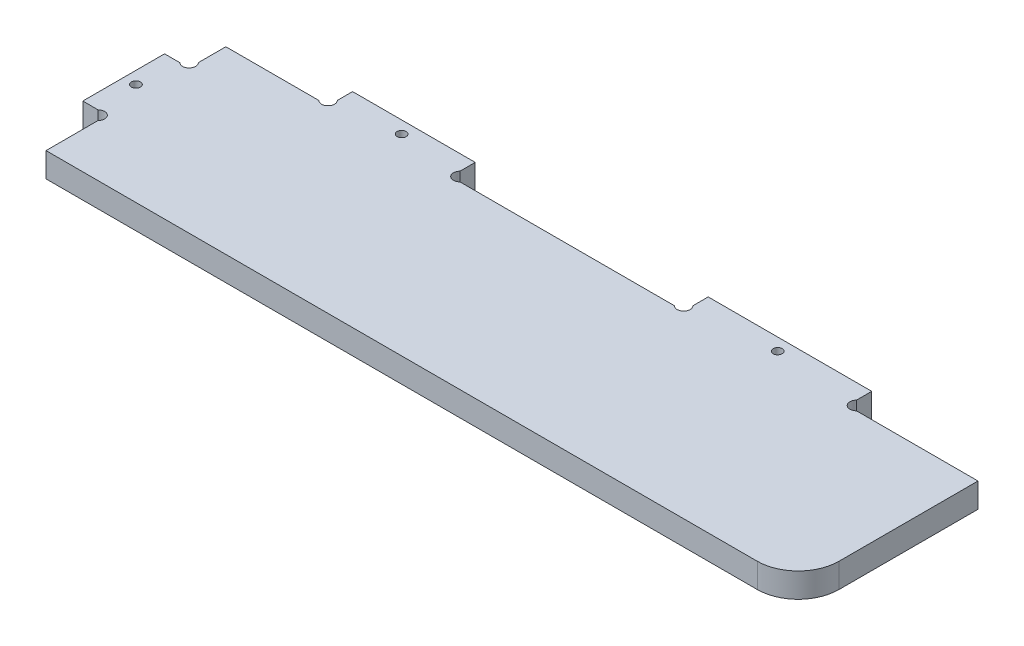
from build123d import *

# Parameters (mm, degrees)
ESQUISSE1_R        = 1.1
BOSS_EXTRU_1_DEPTH = 6


with BuildPart() as part:
    # Esquisse1 → Boss.-Extru.1 (new body)
    with BuildSketch(Plane(origin=(0, 0, 0), x_dir=(1, 0, 0), z_dir=(0, 1, 0))):
        with BuildLine():
            Line((3.7372583, 35), (0, 35))
            Line((0, 35), (0, 15))
            Line((0, 15), (3.7372583, 15))
            ThreePointArc((3.7372583, 15), (6, 15), (6, 12.7372583))
            Line((6, 12.7372583), (6, 0))
            Line((6, 0), (180, 0))
            ThreePointArc((180, 0), (187.071067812, 2.928932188), (190, 10))
            Line((190, 10), (190, 44))
            Line((190, 44), (160.2627417, 44))
            ThreePointArc((160.2627417, 44), (158, 44), (158, 46.2627417))
            Line((158, 46.2627417), (158, 50))
            Line((158, 50), (118, 50))
            Line((118, 50), (118, 46.2627417))
            ThreePointArc((118, 46.2627417), (118, 44), (115.7372583, 44))
            Line((115.7372583, 44), (63.2627417, 44))
            ThreePointArc((63.2627417, 44), (61, 44), (61, 46.2627417))
            Line((61, 46.2627417), (61, 50))
            Line((61, 50), (31, 50))
            Line((31, 50), (31, 46.2627417))
            ThreePointArc((31, 46.2627417), (31, 44), (28.7372583, 44))
            Line((28.7372583, 44), (6, 44))
            Line((6, 44), (6, 37.2627417))
            ThreePointArc((6, 37.2627417), (6, 35), (3.7372583, 35))
        make_face()
        with Locations(Location((3, 25, 0), (0, 0, 270))):
            Circle(ESQUISSE1_R, mode=Mode.SUBTRACT)
        with Locations(Location((46, 47, 0), (0, 0, 270))):
            Circle(ESQUISSE1_R, mode=Mode.SUBTRACT)
        with Locations(Location((138, 47, 0), (0, 0, 270))):
            Circle(ESQUISSE1_R, mode=Mode.SUBTRACT)
    extrude(amount=BOSS_EXTRU_1_DEPTH)


solid = part.part
